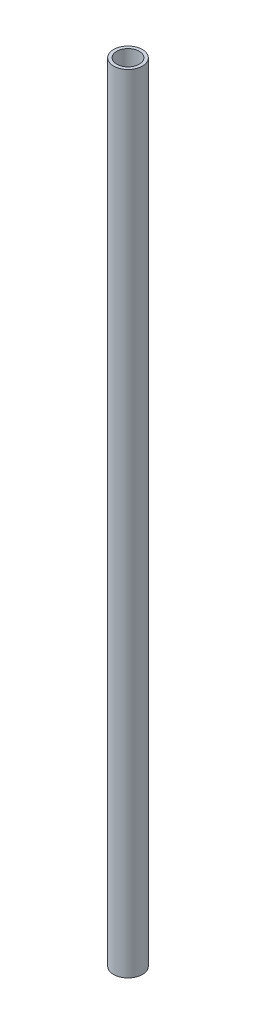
ISO-10303-21;
HEADER;
FILE_DESCRIPTION(('STEP AP214'),'2;1');
FILE_NAME('part.step','',(''),(''),'','','');
FILE_SCHEMA(('AUTOMOTIVE_DESIGN { 1 0 10303 214 1 1 1 1 }'));
ENDSEC;
DATA;
#1=APPLICATION_CONTEXT('core data for automotive mechanical design processes');
#2=APPLICATION_PROTOCOL_DEFINITION('international standard','automotive_design',2000,#1);
#3=PRODUCT_CONTEXT('',#1,'mechanical');
#4=PRODUCT('Part','Part','',(#3));
#5=PRODUCT_RELATED_PRODUCT_CATEGORY('part','',(#4));
#6=PRODUCT_DEFINITION_FORMATION('','',#4);
#7=PRODUCT_DEFINITION_CONTEXT('part definition',#1,'design');
#8=PRODUCT_DEFINITION('design','',#6,#7);
#9=PRODUCT_DEFINITION_SHAPE('','',#8);
#10=(LENGTH_UNIT() NAMED_UNIT(*) SI_UNIT(.MILLI.,.METRE.));
#11=(NAMED_UNIT(*) PLANE_ANGLE_UNIT() SI_UNIT($,.RADIAN.));
#12=(NAMED_UNIT(*) SI_UNIT($,.STERADIAN.) SOLID_ANGLE_UNIT());
#13=UNCERTAINTY_MEASURE_WITH_UNIT(LENGTH_MEASURE(1.E-05),#10,'distance_accuracy_value','');
#14=(GEOMETRIC_REPRESENTATION_CONTEXT(3) GLOBAL_UNCERTAINTY_ASSIGNED_CONTEXT((#13)) GLOBAL_UNIT_ASSIGNED_CONTEXT((#10,
#11,#12)) REPRESENTATION_CONTEXT('',''));
#15=CARTESIAN_POINT('',(0.,0.,0.));
#16=DIRECTION('',(0.,0.,1.));
#17=DIRECTION('',(1.,0.,0.));
#18=AXIS2_PLACEMENT_3D('',#15,#16,#17);
#19=CARTESIAN_POINT('',(0.,914.4,0.));
#20=DIRECTION('',(0.,1.,0.));
#21=DIRECTION('',(0.,0.,1.));
#22=AXIS2_PLACEMENT_3D('',#19,#20,#21);
#23=PLANE('',#22);
#24=CARTESIAN_POINT('',(0.,914.4,0.));
#25=DIRECTION('',(0.,1.,0.));
#26=DIRECTION('',(0.,0.,1.));
#27=AXIS2_PLACEMENT_3D('',#24,#25,#26);
#28=CIRCLE('',#27,16.7005);
#29=CARTESIAN_POINT('',(0.,914.4,16.7005));
#30=VERTEX_POINT('',#29);
#31=EDGE_CURVE('E10',#30,#30,#28,.T.);
#32=ORIENTED_EDGE('',*,*,#31,.T.);
#33=EDGE_LOOP('',(#32));
#34=FACE_BOUND('',#33,.T.);
#35=CARTESIAN_POINT('',(0.,914.4,0.));
#36=DIRECTION('',(0.,1.,0.));
#37=DIRECTION('',(0.,0.,1.));
#38=AXIS2_PLACEMENT_3D('',#35,#36,#37);
#39=CIRCLE('',#38,13.0683);
#40=CARTESIAN_POINT('',(0.,914.4,13.0683));
#41=VERTEX_POINT('',#40);
#42=EDGE_CURVE('E56',#41,#41,#39,.T.);
#43=ORIENTED_EDGE('',*,*,#42,.F.);
#44=EDGE_LOOP('',(#43));
#45=FACE_BOUND('',#44,.T.);
#46=ADVANCED_FACE('F43',(#34,#45),#23,.T.);
#47=CARTESIAN_POINT('',(0.,0.,0.));
#48=DIRECTION('',(0.,1.,0.));
#49=DIRECTION('',(0.,0.,1.));
#50=AXIS2_PLACEMENT_3D('',#47,#48,#49);
#51=PLANE('',#50);
#52=CARTESIAN_POINT('',(0.,0.,0.));
#53=DIRECTION('',(0.,1.,0.));
#54=DIRECTION('',(0.,0.,1.));
#55=AXIS2_PLACEMENT_3D('',#52,#53,#54);
#56=CIRCLE('',#55,16.7005);
#57=CARTESIAN_POINT('',(0.,0.,16.7005));
#58=VERTEX_POINT('',#57);
#59=EDGE_CURVE('E47',#58,#58,#56,.T.);
#60=ORIENTED_EDGE('',*,*,#59,.F.);
#61=EDGE_LOOP('',(#60));
#62=FACE_BOUND('',#61,.T.);
#63=CARTESIAN_POINT('',(0.,0.,0.));
#64=DIRECTION('',(0.,1.,0.));
#65=DIRECTION('',(0.,0.,1.));
#66=AXIS2_PLACEMENT_3D('',#63,#64,#65);
#67=CIRCLE('',#66,13.0683);
#68=CARTESIAN_POINT('',(0.,0.,13.0683));
#69=VERTEX_POINT('',#68);
#70=EDGE_CURVE('E58',#69,#69,#67,.T.);
#71=ORIENTED_EDGE('',*,*,#70,.T.);
#72=EDGE_LOOP('',(#71));
#73=FACE_BOUND('',#72,.T.);
#74=ADVANCED_FACE('F70',(#62,#73),#51,.F.);
#75=CARTESIAN_POINT('',(0.,914.4,0.));
#76=DIRECTION('',(0.,-1.,0.));
#77=DIRECTION('',(0.,0.,-1.));
#78=AXIS2_PLACEMENT_3D('',#75,#76,#77);
#79=CYLINDRICAL_SURFACE('',#78,16.7005);
#80=ORIENTED_EDGE('',*,*,#31,.F.);
#81=EDGE_LOOP('',(#80));
#82=FACE_BOUND('',#81,.T.);
#83=ORIENTED_EDGE('',*,*,#59,.T.);
#84=EDGE_LOOP('',(#83));
#85=FACE_BOUND('',#84,.T.);
#86=ADVANCED_FACE('F45',(#82,#85),#79,.T.);
#87=CARTESIAN_POINT('',(0.,914.4,0.));
#88=DIRECTION('',(0.,-1.,0.));
#89=DIRECTION('',(0.,0.,-1.));
#90=AXIS2_PLACEMENT_3D('',#87,#88,#89);
#91=CYLINDRICAL_SURFACE('',#90,13.0683);
#92=ORIENTED_EDGE('',*,*,#42,.T.);
#93=EDGE_LOOP('',(#92));
#94=FACE_BOUND('',#93,.T.);
#95=ORIENTED_EDGE('',*,*,#70,.F.);
#96=EDGE_LOOP('',(#95));
#97=FACE_BOUND('',#96,.T.);
#98=ADVANCED_FACE('F66',(#94,#97),#91,.F.);
#99=CLOSED_SHELL('',(#46,#74,#86,#98));
#100=MANIFOLD_SOLID_BREP('B2',#99);
#101=ADVANCED_BREP_SHAPE_REPRESENTATION('',(#18,#100),#14);
#102=SHAPE_DEFINITION_REPRESENTATION(#9,#101);
ENDSEC;
END-ISO-10303-21;
